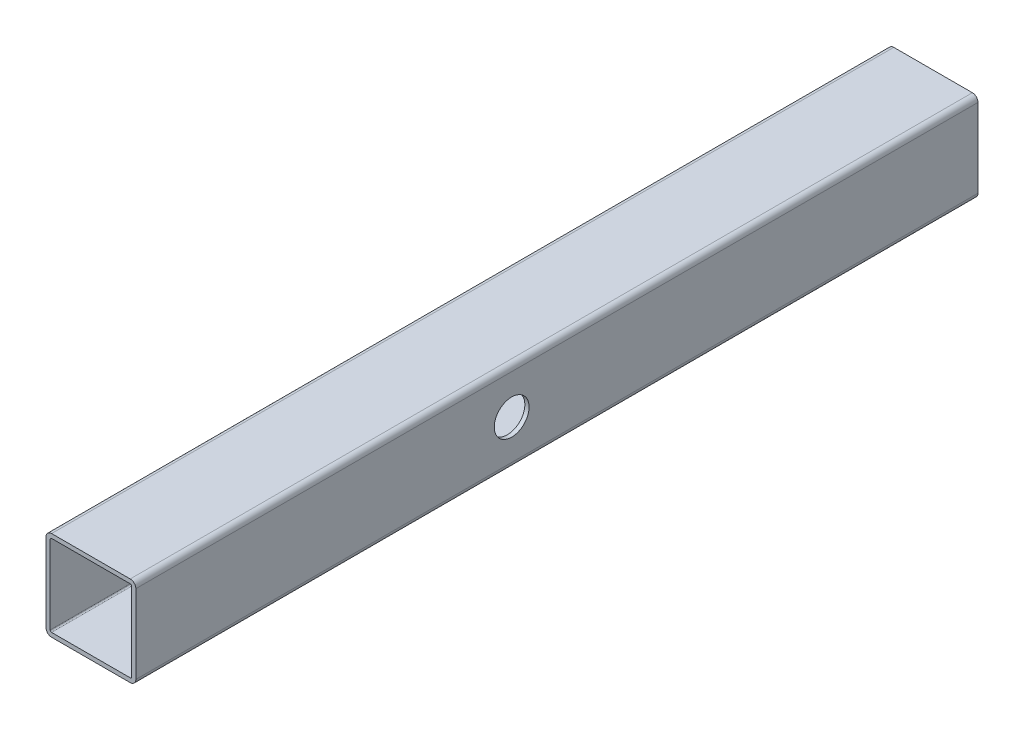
from build123d import *

# Parameters (mm, degrees)
EXTRUDE1_DEPTH     = 476.25
SKETCH2_R          = 19.685
CUT_EXTRUDE1_DEPTH = 490.609295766


with BuildPart() as part:
    # Sketch1 → Extrude1 (new, symmetric)
    with BuildSketch(Plane.XY):
        with BuildLine():
            Line((-44.45, 50.8), (44.45, 50.8))
            ThreePointArc((44.45, 50.8), (48.940128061, 48.940128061), (50.8, 44.45))
            Line((50.8, 44.45), (50.8, -44.45))
            ThreePointArc((50.8, -44.45), (48.940128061, -48.940128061), (44.45, -50.8))
            Line((44.45, -50.8), (-44.45, -50.8))
            ThreePointArc((-44.45, -50.8), (-48.940128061, -48.940128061), (-50.8, -44.45))
            Line((-50.8, -44.45), (-50.8, 44.45))
            ThreePointArc((-50.8, 44.45), (-48.940128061, 48.940128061), (-44.45, 50.8))
        make_face()
        with BuildLine():
            Line((-44.45, 46.0375), (44.45, 46.0375))
            ThreePointArc((44.45, 46.0375), (45.572532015, 45.572532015), (46.0375, 44.45))
            Line((46.0375, 44.45), (46.0375, -44.45))
            ThreePointArc((46.0375, -44.45), (45.572532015, -45.572532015), (44.45, -46.0375))
            Line((44.45, -46.0375), (-44.45, -46.0375))
            ThreePointArc((-44.45, -46.0375), (-45.572532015, -45.572532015), (-46.0375, -44.45))
            Line((-46.0375, -44.45), (-46.0375, 44.45))
            ThreePointArc((-46.0375, 44.45), (-45.572532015, 45.572532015), (-44.45, 46.0375))
        make_face(mode=Mode.SUBTRACT)
    extrude(amount=EXTRUDE1_DEPTH, both=True)

    # Sketch2 → Cut-Extrude1 (cut, through all)
    with BuildSketch(Plane.ZY.offset(50.8)):
        with Locations(Location((51.181, 0, 0), (0, 0, 270))):
            Circle(SKETCH2_R)
    extrude(amount=-CUT_EXTRUDE1_DEPTH, mode=Mode.SUBTRACT)


solid = part.part
